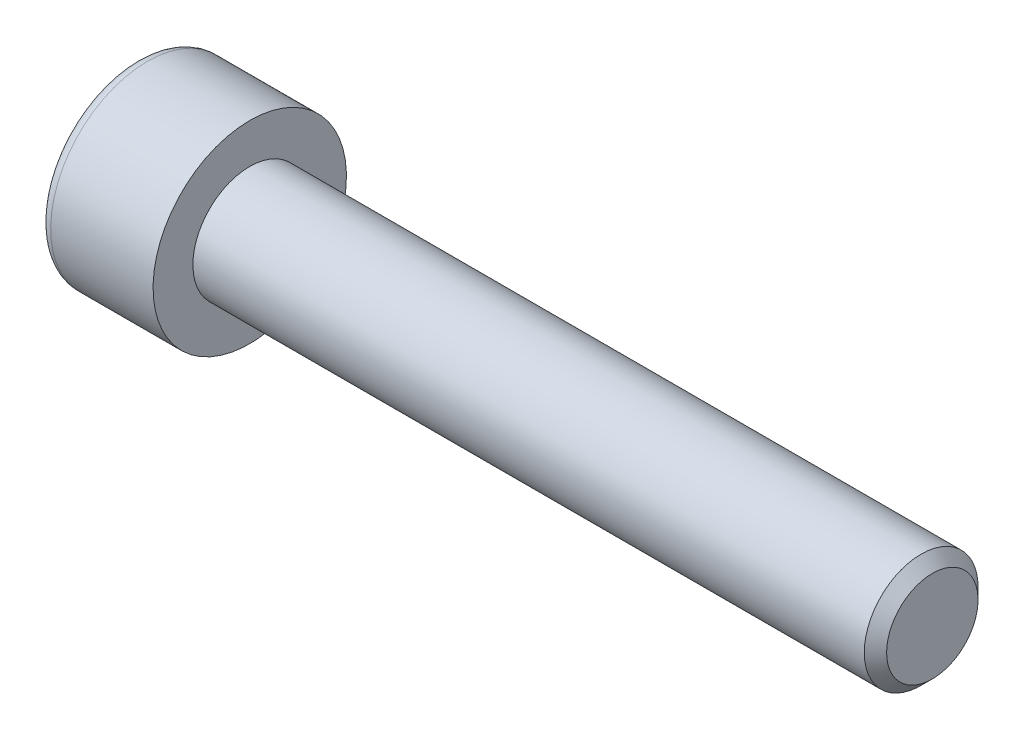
ISO-10303-21;
HEADER;
FILE_DESCRIPTION(('STEP AP214'),'2;1');
FILE_NAME('part.step','',(''),(''),'','','');
FILE_SCHEMA(('AUTOMOTIVE_DESIGN { 1 0 10303 214 1 1 1 1 }'));
ENDSEC;
DATA;
#1=APPLICATION_CONTEXT('core data for automotive mechanical design processes');
#2=APPLICATION_PROTOCOL_DEFINITION('international standard','automotive_design',2000,#1);
#3=PRODUCT_CONTEXT('',#1,'mechanical');
#4=PRODUCT('Part','Part','',(#3));
#5=PRODUCT_RELATED_PRODUCT_CATEGORY('part','',(#4));
#6=PRODUCT_DEFINITION_FORMATION('','',#4);
#7=PRODUCT_DEFINITION_CONTEXT('part definition',#1,'design');
#8=PRODUCT_DEFINITION('design','',#6,#7);
#9=PRODUCT_DEFINITION_SHAPE('','',#8);
#10=(LENGTH_UNIT() NAMED_UNIT(*) SI_UNIT(.MILLI.,.METRE.));
#11=(NAMED_UNIT(*) PLANE_ANGLE_UNIT() SI_UNIT($,.RADIAN.));
#12=(NAMED_UNIT(*) SI_UNIT($,.STERADIAN.) SOLID_ANGLE_UNIT());
#13=UNCERTAINTY_MEASURE_WITH_UNIT(LENGTH_MEASURE(1.E-05),#10,'distance_accuracy_value','');
#14=(GEOMETRIC_REPRESENTATION_CONTEXT(3) GLOBAL_UNCERTAINTY_ASSIGNED_CONTEXT((#13)) GLOBAL_UNIT_ASSIGNED_CONTEXT((#10,
#11,#12)) REPRESENTATION_CONTEXT('',''));
#15=CARTESIAN_POINT('',(0.,0.,0.));
#16=DIRECTION('',(0.,0.,1.));
#17=DIRECTION('',(1.,0.,0.));
#18=AXIS2_PLACEMENT_3D('',#15,#16,#17);
#19=CARTESIAN_POINT('',(-1.16666666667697,0.,0.));
#20=DIRECTION('',(-1.,0.,0.));
#21=DIRECTION('',(0.,0.,1.));
#22=AXIS2_PLACEMENT_3D('',#19,#20,#21);
#23=CONICAL_SURFACE('',#22,0.,1.04719755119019);
#24=CARTESIAN_POINT('',(-1.16666666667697,0.,0.));
#25=VERTEX_POINT('',#24);
#26=VERTEX_LOOP('',#25);
#27=FACE_BOUND('',#26,.T.);
#28=CARTESIAN_POINT('',(-2.50000000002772,-6.92989317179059E-12,-2.3094010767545));
#29=CARTESIAN_POINT('',(-2.47069554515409,-0.0878878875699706,-2.25865898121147));
#30=CARTESIAN_POINT('',(-2.44404467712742,-0.176534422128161,-2.20747888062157));
#31=CARTESIAN_POINT('',(-2.39752638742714,-0.355362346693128,-2.10423253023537));
#32=CARTESIAN_POINT('',(-2.37767542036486,-0.445546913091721,-2.05216444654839));
#33=CARTESIAN_POINT('',(-2.34677595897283,-0.624798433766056,-1.94867353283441));
#34=CARTESIAN_POINT('',(-2.33552178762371,-0.71383781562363,-1.89726662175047));
#35=CARTESIAN_POINT('',(-2.32208916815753,-0.892335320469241,-1.79421103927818));
#36=CARTESIAN_POINT('',(-2.3198995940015,-0.981792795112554,-1.74256274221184));
#37=CARTESIAN_POINT('',(-2.32446629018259,-1.14893448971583,-1.64606343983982));
#38=CARTESIAN_POINT('',(-2.33010128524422,-1.22664379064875,-1.60119795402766));
#39=CARTESIAN_POINT('',(-2.34795730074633,-1.38155614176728,-1.51175926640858));
#40=CARTESIAN_POINT('',(-2.36018441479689,-1.45875865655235,-1.46718637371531));
#41=CARTESIAN_POINT('',(-2.39074983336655,-1.61399014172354,-1.37756343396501));
#42=CARTESIAN_POINT('',(-2.40921764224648,-1.69199947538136,-1.33252472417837));
#43=CARTESIAN_POINT('',(-2.45113176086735,-1.84685497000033,-1.24311886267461));
#44=CARTESIAN_POINT('',(-2.47456822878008,-1.92370311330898,-1.19875056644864));
#45=CARTESIAN_POINT('',(-2.50000000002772,-1.99999999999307,-1.15470053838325));
#46=B_SPLINE_CURVE_WITH_KNOTS('',3,(#28,#29,#30,#31,#32,#33,#34,#35,#36,#37,#38,#39,#40,#41,#42,
#43,#44,#45),.UNSPECIFIED.,.F.,.F.,(4,2,2,2,2,2,2,2,4),(0.,0.317016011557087,0.634793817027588,
0.944707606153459,1.25424088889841,1.52370778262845,1.79342419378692,2.0691216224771,
2.34427797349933),.UNSPECIFIED.);
#47=CARTESIAN_POINT('',(-2.50000000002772,0.,-2.3094010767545));
#48=VERTEX_POINT('',#47);
#49=CARTESIAN_POINT('',(-2.50000000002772,-1.99999999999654,-1.15470053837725));
#50=VERTEX_POINT('',#49);
#51=EDGE_CURVE('E137',#48,#50,#46,.T.);
#52=ORIENTED_EDGE('',*,*,#51,.T.);
#53=CARTESIAN_POINT('',(-2.50000000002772,-2.,-1.15470053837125));
#54=CARTESIAN_POINT('',(-2.47263377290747,-2.,-1.05991107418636));
#55=CARTESIAN_POINT('',(-2.44757921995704,-2.,-0.964371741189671));
#56=CARTESIAN_POINT('',(-2.40329840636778,-2.,-0.771741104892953));
#57=CARTESIAN_POINT('',(-2.38408518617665,-2.,-0.674646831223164));
#58=CARTESIAN_POINT('',(-2.35318800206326,-2.,-0.481547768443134));
#59=CARTESIAN_POINT('',(-2.34133930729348,-2.,-0.385570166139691));
#60=CARTESIAN_POINT('',(-2.32543313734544,-2.,-0.193061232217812));
#61=CARTESIAN_POINT('',(-2.32136720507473,-2.,-0.0965306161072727));
#62=CARTESIAN_POINT('',(-2.32136720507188,-2.,0.0965306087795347));
#63=CARTESIAN_POINT('',(-2.32543313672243,-2.,0.193061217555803));
#64=CARTESIAN_POINT('',(-2.34133930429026,-2.,0.385570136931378));
#65=CARTESIAN_POINT('',(-2.35318799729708,-2.,0.481547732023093));
#66=CARTESIAN_POINT('',(-2.38408517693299,-2.,0.674646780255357));
#67=CARTESIAN_POINT('',(-2.40329839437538,-2.,0.771741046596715));
#68=CARTESIAN_POINT('',(-2.44757920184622,-2.,0.964371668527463));
#69=CARTESIAN_POINT('',(-2.47263375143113,-2.,1.05991099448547));
#70=CARTESIAN_POINT('',(-2.4999999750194,-2.,1.15470045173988));
#71=B_SPLINE_CURVE_WITH_KNOTS('',3,(#53,#54,#55,#56,#57,#58,#59,#60,#61,#62,#63,#64,#65,#66,#67,
#68,#69,#70),.UNSPECIFIED.,.F.,.F.,(4,2,2,2,2,2,2,2,4),(0.,0.296073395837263,0.592802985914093,
0.882630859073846,1.17214361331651,1.46165634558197,1.75148419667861,2.04821376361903,
2.34428713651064),.UNSPECIFIED.);
#72=CARTESIAN_POINT('',(-2.49999999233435,-2.00000001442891,1.15470048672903));
#73=VERTEX_POINT('',#72);
#74=EDGE_CURVE('E241',#50,#73,#71,.T.);
#75=ORIENTED_EDGE('',*,*,#74,.T.);
#76=CARTESIAN_POINT('',(-2.50000003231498,-2.00000000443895,1.15470049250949));
#77=CARTESIAN_POINT('',(-2.47069556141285,-1.91211212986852,1.20544260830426));
#78=CARTESIAN_POINT('',(-2.4440446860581,-1.82346559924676,1.25662271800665));
#79=CARTESIAN_POINT('',(-2.39752638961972,-1.64463767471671,1.35986907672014));
#80=CARTESIAN_POINT('',(-2.3776754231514,-1.55445310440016,1.41193715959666));
#81=CARTESIAN_POINT('',(-2.34677596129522,-1.37520157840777,1.51542807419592));
#82=CARTESIAN_POINT('',(-2.33552178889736,-1.28616219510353,1.56683498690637));
#83=CARTESIAN_POINT('',(-2.32208916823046,-1.10766468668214,1.66989057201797));
#84=CARTESIAN_POINT('',(-2.31989959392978,-1.01820720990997,1.7215388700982));
#85=CARTESIAN_POINT('',(-2.32446629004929,-0.851065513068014,1.81803817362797));
#86=CARTESIAN_POINT('',(-2.33010128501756,-0.773356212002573,1.86290365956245));
#87=CARTESIAN_POINT('',(-2.34795730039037,-0.618443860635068,1.95234234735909));
#88=CARTESIAN_POINT('',(-2.36018441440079,-0.541241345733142,1.9969152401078));
#89=CARTESIAN_POINT('',(-2.39074983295,-0.386009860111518,2.08653818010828));
#90=CARTESIAN_POINT('',(-2.40921764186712,-0.308000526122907,2.13157689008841));
#91=CARTESIAN_POINT('',(-2.4511317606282,-0.153145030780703,2.2209827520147));
#92=CARTESIAN_POINT('',(-2.47456822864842,-0.0762968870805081,2.26535104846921));
#93=CARTESIAN_POINT('',(-2.50000000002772,-6.92925556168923E-12,2.3094010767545));
#94=B_SPLINE_CURVE_WITH_KNOTS('',3,(#76,#77,#78,#79,#80,#81,#82,#83,#84,#85,#86,#87,#88,#89,#90,
#91,#92,#93),.UNSPECIFIED.,.F.,.F.,(4,2,2,2,2,2,2,2,4),(0.,0.317016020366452,0.634793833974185,
0.944707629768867,1.25424091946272,1.52370781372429,1.79342422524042,2.0691216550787,
2.34427800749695),.UNSPECIFIED.);
#95=CARTESIAN_POINT('',(-2.50000000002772,0.,2.3094010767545));
#96=VERTEX_POINT('',#95);
#97=EDGE_CURVE('E257',#73,#96,#94,.T.);
#98=ORIENTED_EDGE('',*,*,#97,.T.);
#99=CARTESIAN_POINT('',(-2.50000000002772,6.92876375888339E-12,2.3094010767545));
#100=CARTESIAN_POINT('',(-2.47069554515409,0.0878878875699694,2.25865898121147));
#101=CARTESIAN_POINT('',(-2.44404467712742,0.17653442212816,2.20747888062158));
#102=CARTESIAN_POINT('',(-2.39752638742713,0.355362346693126,2.10423253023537));
#103=CARTESIAN_POINT('',(-2.37767542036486,0.445546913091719,2.05216444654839));
#104=CARTESIAN_POINT('',(-2.34677595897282,0.624798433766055,1.94867353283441));
#105=CARTESIAN_POINT('',(-2.33552178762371,0.713837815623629,1.89726662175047));
#106=CARTESIAN_POINT('',(-2.32208916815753,0.89233532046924,1.79421103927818));
#107=CARTESIAN_POINT('',(-2.3198995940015,0.981792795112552,1.74256274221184));
#108=CARTESIAN_POINT('',(-2.32446629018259,1.14893448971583,1.64606343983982));
#109=CARTESIAN_POINT('',(-2.33010128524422,1.22664379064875,1.60119795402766));
#110=CARTESIAN_POINT('',(-2.34795730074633,1.38155614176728,1.51175926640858));
#111=CARTESIAN_POINT('',(-2.36018441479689,1.45875865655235,1.46718637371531));
#112=CARTESIAN_POINT('',(-2.39074983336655,1.61399014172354,1.37756343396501));
#113=CARTESIAN_POINT('',(-2.40921764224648,1.69199947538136,1.33252472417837));
#114=CARTESIAN_POINT('',(-2.45113176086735,1.84685497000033,1.24311886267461));
#115=CARTESIAN_POINT('',(-2.47456822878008,1.92370311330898,1.19875056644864));
#116=CARTESIAN_POINT('',(-2.50000000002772,1.99999999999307,1.15470053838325));
#117=B_SPLINE_CURVE_WITH_KNOTS('',3,(#99,#100,#101,#102,#103,#104,#105,#106,#107,#108,#109,#110,
#111,#112,#113,#114,#115,#116),.UNSPECIFIED.,.F.,.F.,(4,2,2,2,2,2,2,2,4),(0.,0.317016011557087,
0.634793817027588,0.944707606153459,1.25424088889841,1.52370778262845,1.79342419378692,
2.0691216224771,2.34427797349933),.UNSPECIFIED.);
#118=CARTESIAN_POINT('',(-2.50000000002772,1.99999999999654,1.15470053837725));
#119=VERTEX_POINT('',#118);
#120=EDGE_CURVE('E262',#96,#119,#117,.T.);
#121=ORIENTED_EDGE('',*,*,#120,.T.);
#122=CARTESIAN_POINT('',(-2.50000000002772,2.,1.15470053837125));
#123=CARTESIAN_POINT('',(-2.47263377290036,2.,1.05991107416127));
#124=CARTESIAN_POINT('',(-2.44757921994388,2.,0.964371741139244));
#125=CARTESIAN_POINT('',(-2.40329840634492,2.,0.77174110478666));
#126=CARTESIAN_POINT('',(-2.38408518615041,2.,0.674646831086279));
#127=CARTESIAN_POINT('',(-2.35318800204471,2.,0.48154776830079));
#128=CARTESIAN_POINT('',(-2.34133930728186,2.,0.385570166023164));
#129=CARTESIAN_POINT('',(-2.32543313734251,2.,0.193061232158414));
#130=CARTESIAN_POINT('',(-2.32136720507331,2.,0.0965306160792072));
#131=CARTESIAN_POINT('',(-2.32136720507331,2.,-0.0965306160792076));
#132=CARTESIAN_POINT('',(-2.32543313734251,2.,-0.193061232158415));
#133=CARTESIAN_POINT('',(-2.34133930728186,2.,-0.385570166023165));
#134=CARTESIAN_POINT('',(-2.35318800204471,2.,-0.481547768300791));
#135=CARTESIAN_POINT('',(-2.38408518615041,2.,-0.674646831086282));
#136=CARTESIAN_POINT('',(-2.40329840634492,2.,-0.771741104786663));
#137=CARTESIAN_POINT('',(-2.44757921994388,2.,-0.964371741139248));
#138=CARTESIAN_POINT('',(-2.47263377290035,2.,-1.05991107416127));
#139=CARTESIAN_POINT('',(-2.50000000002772,2.,-1.15470053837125));
#140=B_SPLINE_CURVE_WITH_KNOTS('',3,(#122,#123,#124,#125,#126,#127,#128,#129,#130,#131,#132,
#133,#134,#135,#136,#137,#138,#139),.UNSPECIFIED.,.F.,.F.,(4,2,2,2,2,2,2,2,4),(0.,
0.296073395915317,0.592802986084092,0.882630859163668,1.17214361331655,1.46165636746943,
1.751484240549,2.04821383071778,2.3442872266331),.UNSPECIFIED.);
#141=CARTESIAN_POINT('',(-2.50000000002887,2.,-1.15470053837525));
#142=VERTEX_POINT('',#141);
#143=EDGE_CURVE('E20',#119,#142,#140,.T.);
#144=ORIENTED_EDGE('',*,*,#143,.T.);
#145=CARTESIAN_POINT('',(-2.50000000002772,1.99999999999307,-1.15470053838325));
#146=CARTESIAN_POINT('',(-2.47069554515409,1.91211211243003,-1.20544263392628));
#147=CARTESIAN_POINT('',(-2.44404467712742,1.82346557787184,-1.25662273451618));
#148=CARTESIAN_POINT('',(-2.39752638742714,1.64463765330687,-1.35986908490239));
#149=CARTESIAN_POINT('',(-2.37767542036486,1.55445308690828,-1.41193716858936));
#150=CARTESIAN_POINT('',(-2.34677595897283,1.37520156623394,-1.51542808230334));
#151=CARTESIAN_POINT('',(-2.33552178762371,1.28616218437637,-1.56683499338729));
#152=CARTESIAN_POINT('',(-2.32208916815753,1.10766467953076,-1.66989057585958));
#153=CARTESIAN_POINT('',(-2.3198995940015,1.01820720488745,-1.72153887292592));
#154=CARTESIAN_POINT('',(-2.32446629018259,0.851065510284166,-1.81803817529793));
#155=CARTESIAN_POINT('',(-2.33010128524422,0.77335620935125,-1.86290366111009));
#156=CARTESIAN_POINT('',(-2.34795730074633,0.61844385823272,-1.95234234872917));
#157=CARTESIAN_POINT('',(-2.36018441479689,0.541241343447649,-1.99691524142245));
#158=CARTESIAN_POINT('',(-2.39074983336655,0.386009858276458,-2.08653818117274));
#159=CARTESIAN_POINT('',(-2.40921764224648,0.308000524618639,-2.13157689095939));
#160=CARTESIAN_POINT('',(-2.45113176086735,0.15314502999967,-2.22098275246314));
#161=CARTESIAN_POINT('',(-2.47456822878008,0.0762968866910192,-2.26535104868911));
#162=CARTESIAN_POINT('',(-2.50000000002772,6.92873559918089E-12,-2.3094010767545));
#163=B_SPLINE_CURVE_WITH_KNOTS('',3,(#145,#146,#147,#148,#149,#150,#151,#152,#153,#154,#155,
#156,#157,#158,#159,#160,#161,#162),.UNSPECIFIED.,.F.,.F.,(4,2,2,2,2,2,2,2,4),(0.,
0.317016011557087,0.634793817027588,0.944707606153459,1.25424088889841,1.52370778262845,
1.79342419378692,2.0691216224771,2.34427797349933),.UNSPECIFIED.);
#164=EDGE_CURVE('E90',#142,#48,#163,.T.);
#165=ORIENTED_EDGE('',*,*,#164,.T.);
#166=EDGE_LOOP('',(#52,#75,#98,#121,#144,#165));
#167=FACE_BOUND('',#166,.T.);
#168=ADVANCED_FACE('F16',(#27,#167),#23,.F.);
#169=CARTESIAN_POINT('',(-5.,2.,1.15470053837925));
#170=DIRECTION('',(0.,1.,0.));
#171=DIRECTION('',(0.,0.,1.));
#172=AXIS2_PLACEMENT_3D('',#169,#170,#171);
#173=PLANE('',#172);
#174=DIRECTION('',(1.,0.,0.));
#175=VECTOR('',#174,1.);
#176=CARTESIAN_POINT('',(-5.,2.,1.15470053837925));
#177=LINE('',#176,#175);
#178=CARTESIAN_POINT('',(-5.,2.,1.15470053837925));
#179=VERTEX_POINT('',#178);
#180=EDGE_CURVE('E84',#119,#179,#177,.F.);
#181=ORIENTED_EDGE('',*,*,#180,.T.);
#182=DIRECTION('',(0.,0.,1.));
#183=VECTOR('',#182,1.);
#184=CARTESIAN_POINT('',(-5.,2.,0.));
#185=LINE('',#184,#183);
#186=CARTESIAN_POINT('',(-5.,2.,-1.15470053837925));
#187=VERTEX_POINT('',#186);
#188=EDGE_CURVE('E78',#187,#179,#185,.T.);
#189=ORIENTED_EDGE('',*,*,#188,.F.);
#190=DIRECTION('',(1.,0.,0.));
#191=VECTOR('',#190,1.);
#192=CARTESIAN_POINT('',(-5.,2.,-1.15470053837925));
#193=LINE('',#192,#191);
#194=EDGE_CURVE('E81',#187,#142,#193,.T.);
#195=ORIENTED_EDGE('',*,*,#194,.T.);
#196=ORIENTED_EDGE('',*,*,#143,.F.);
#197=EDGE_LOOP('',(#181,#189,#195,#196));
#198=FACE_BOUND('',#197,.T.);
#199=ADVANCED_FACE('F80',(#198),#173,.F.);
#200=CARTESIAN_POINT('',(-5.,0.,2.3094010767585));
#201=DIRECTION('',(0.,0.5,0.866025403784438));
#202=DIRECTION('',(0.,-0.866025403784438,0.5));
#203=AXIS2_PLACEMENT_3D('',#200,#201,#202);
#204=PLANE('',#203);
#205=DIRECTION('',(1.,0.,0.));
#206=VECTOR('',#205,1.);
#207=CARTESIAN_POINT('',(-5.,0.,2.3094010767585));
#208=LINE('',#207,#206);
#209=CARTESIAN_POINT('',(-5.,0.,2.3094010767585));
#210=VERTEX_POINT('',#209);
#211=EDGE_CURVE('E260',#96,#210,#208,.F.);
#212=ORIENTED_EDGE('',*,*,#211,.T.);
#213=DIRECTION('',(0.,-0.866025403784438,0.5));
#214=VECTOR('',#213,1.);
#215=CARTESIAN_POINT('',(-5.,2.,1.15470053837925));
#216=LINE('',#215,#214);
#217=EDGE_CURVE('E89',#179,#210,#216,.T.);
#218=ORIENTED_EDGE('',*,*,#217,.F.);
#219=ORIENTED_EDGE('',*,*,#180,.F.);
#220=ORIENTED_EDGE('',*,*,#120,.F.);
#221=EDGE_LOOP('',(#212,#218,#219,#220));
#222=FACE_BOUND('',#221,.T.);
#223=ADVANCED_FACE('F226',(#222),#204,.F.);
#224=CARTESIAN_POINT('',(-5.,-2.,1.15470053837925));
#225=DIRECTION('',(0.,-0.5,0.866025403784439));
#226=DIRECTION('',(0.,-0.866025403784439,-0.5));
#227=AXIS2_PLACEMENT_3D('',#224,#225,#226);
#228=PLANE('',#227);
#229=DIRECTION('',(1.,0.,0.));
#230=VECTOR('',#229,1.);
#231=CARTESIAN_POINT('',(-5.,-2.,1.15470053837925));
#232=LINE('',#231,#230);
#233=CARTESIAN_POINT('',(-5.,-2.,1.15470053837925));
#234=VERTEX_POINT('',#233);
#235=EDGE_CURVE('E246',#73,#234,#232,.F.);
#236=ORIENTED_EDGE('',*,*,#235,.T.);
#237=DIRECTION('',(0.,-0.866025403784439,-0.5));
#238=VECTOR('',#237,1.);
#239=CARTESIAN_POINT('',(-5.,0.,2.3094010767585));
#240=LINE('',#239,#238);
#241=EDGE_CURVE('E114',#210,#234,#240,.T.);
#242=ORIENTED_EDGE('',*,*,#241,.F.);
#243=ORIENTED_EDGE('',*,*,#211,.F.);
#244=ORIENTED_EDGE('',*,*,#97,.F.);
#245=EDGE_LOOP('',(#236,#242,#243,#244));
#246=FACE_BOUND('',#245,.T.);
#247=ADVANCED_FACE('F222',(#246),#228,.F.);
#248=CARTESIAN_POINT('',(-5.,-2.,-1.15470053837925));
#249=DIRECTION('',(0.,-1.,0.));
#250=DIRECTION('',(0.,0.,-1.));
#251=AXIS2_PLACEMENT_3D('',#248,#249,#250);
#252=PLANE('',#251);
#253=DIRECTION('',(1.,0.,0.));
#254=VECTOR('',#253,1.);
#255=CARTESIAN_POINT('',(-5.,-2.,-1.15470053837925));
#256=LINE('',#255,#254);
#257=CARTESIAN_POINT('',(-5.,-2.,-1.15470053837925));
#258=VERTEX_POINT('',#257);
#259=EDGE_CURVE('E243',#50,#258,#256,.F.);
#260=ORIENTED_EDGE('',*,*,#259,.T.);
#261=DIRECTION('',(0.,0.,1.));
#262=VECTOR('',#261,1.);
#263=CARTESIAN_POINT('',(-5.,-2.,0.));
#264=LINE('',#263,#262);
#265=EDGE_CURVE('E104',#234,#258,#264,.F.);
#266=ORIENTED_EDGE('',*,*,#265,.F.);
#267=ORIENTED_EDGE('',*,*,#235,.F.);
#268=ORIENTED_EDGE('',*,*,#74,.F.);
#269=EDGE_LOOP('',(#260,#266,#267,#268));
#270=FACE_BOUND('',#269,.T.);
#271=ADVANCED_FACE('F219',(#270),#252,.F.);
#272=CARTESIAN_POINT('',(-5.,0.,-2.3094010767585));
#273=DIRECTION('',(0.,-0.5,-0.866025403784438));
#274=DIRECTION('',(0.,0.866025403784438,-0.5));
#275=AXIS2_PLACEMENT_3D('',#272,#273,#274);
#276=PLANE('',#275);
#277=DIRECTION('',(1.,0.,0.));
#278=VECTOR('',#277,1.);
#279=CARTESIAN_POINT('',(-5.,0.,-2.3094010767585));
#280=LINE('',#279,#278);
#281=CARTESIAN_POINT('',(-5.,0.,-2.3094010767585));
#282=VERTEX_POINT('',#281);
#283=EDGE_CURVE('E40',#48,#282,#280,.F.);
#284=ORIENTED_EDGE('',*,*,#283,.T.);
#285=DIRECTION('',(0.,0.866025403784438,-0.500000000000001));
#286=VECTOR('',#285,1.);
#287=CARTESIAN_POINT('',(-5.,-2.,-1.15470053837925));
#288=LINE('',#287,#286);
#289=EDGE_CURVE('E99',#258,#282,#288,.T.);
#290=ORIENTED_EDGE('',*,*,#289,.F.);
#291=ORIENTED_EDGE('',*,*,#259,.F.);
#292=ORIENTED_EDGE('',*,*,#51,.F.);
#293=EDGE_LOOP('',(#284,#290,#291,#292));
#294=FACE_BOUND('',#293,.T.);
#295=ADVANCED_FACE('F147',(#294),#276,.F.);
#296=CARTESIAN_POINT('',(-5.,2.,-1.15470053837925));
#297=DIRECTION('',(0.,0.5,-0.866025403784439));
#298=DIRECTION('',(0.,0.866025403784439,0.5));
#299=AXIS2_PLACEMENT_3D('',#296,#297,#298);
#300=PLANE('',#299);
#301=ORIENTED_EDGE('',*,*,#194,.F.);
#302=DIRECTION('',(0.,0.866025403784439,0.5));
#303=VECTOR('',#302,1.);
#304=CARTESIAN_POINT('',(-5.,0.,-2.3094010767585));
#305=LINE('',#304,#303);
#306=EDGE_CURVE('E94',#282,#187,#305,.T.);
#307=ORIENTED_EDGE('',*,*,#306,.F.);
#308=ORIENTED_EDGE('',*,*,#283,.F.);
#309=ORIENTED_EDGE('',*,*,#164,.F.);
#310=EDGE_LOOP('',(#301,#307,#308,#309));
#311=FACE_BOUND('',#310,.T.);
#312=ADVANCED_FACE('F93',(#311),#300,.F.);
#313=CARTESIAN_POINT('',(-5.,3.27970053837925,0.));
#314=DIRECTION('',(-1.,0.,0.));
#315=DIRECTION('',(0.,-1.,0.));
#316=AXIS2_PLACEMENT_3D('',#313,#314,#315);
#317=PLANE('',#316);
#318=CARTESIAN_POINT('',(-5.,0.,0.));
#319=DIRECTION('',(1.,0.,0.));
#320=DIRECTION('',(0.,1.,0.));
#321=AXIS2_PLACEMENT_3D('',#318,#319,#320);
#322=CIRCLE('',#321,3.75);
#323=CARTESIAN_POINT('',(-5.,3.75,0.));
#324=VERTEX_POINT('',#323);
#325=EDGE_CURVE('E100',#324,#324,#322,.T.);
#326=ORIENTED_EDGE('',*,*,#325,.F.);
#327=EDGE_LOOP('',(#326));
#328=FACE_BOUND('',#327,.T.);
#329=ORIENTED_EDGE('',*,*,#289,.T.);
#330=ORIENTED_EDGE('',*,*,#306,.T.);
#331=ORIENTED_EDGE('',*,*,#188,.T.);
#332=ORIENTED_EDGE('',*,*,#217,.T.);
#333=ORIENTED_EDGE('',*,*,#241,.T.);
#334=ORIENTED_EDGE('',*,*,#265,.T.);
#335=EDGE_LOOP('',(#329,#330,#331,#332,#333,#334));
#336=FACE_BOUND('',#335,.T.);
#337=ADVANCED_FACE('F97',(#328,#336),#317,.T.);
#338=CARTESIAN_POINT('',(-4.5,0.,0.));
#339=DIRECTION('',(1.,0.,0.));
#340=DIRECTION('',(0.,0.,-1.));
#341=AXIS2_PLACEMENT_3D('',#338,#339,#340);
#342=TOROIDAL_SURFACE('',#341,3.75,0.5);
#343=CARTESIAN_POINT('',(-4.5,0.,0.));
#344=DIRECTION('',(1.,0.,0.));
#345=DIRECTION('',(0.,1.,0.));
#346=AXIS2_PLACEMENT_3D('',#343,#344,#345);
#347=CIRCLE('',#346,4.25);
#348=CARTESIAN_POINT('',(-4.5,4.25,0.));
#349=VERTEX_POINT('',#348);
#350=EDGE_CURVE('E103',#349,#349,#347,.T.);
#351=ORIENTED_EDGE('',*,*,#350,.F.);
#352=EDGE_LOOP('',(#351));
#353=FACE_BOUND('',#352,.T.);
#354=ORIENTED_EDGE('',*,*,#325,.T.);
#355=EDGE_LOOP('',(#354));
#356=FACE_BOUND('',#355,.T.);
#357=ADVANCED_FACE('F153',(#353,#356),#342,.T.);
#358=CARTESIAN_POINT('',(-2.5,0.,0.));
#359=DIRECTION('',(1.,0.,0.));
#360=DIRECTION('',(0.,1.,0.));
#361=AXIS2_PLACEMENT_3D('',#358,#359,#360);
#362=CYLINDRICAL_SURFACE('',#361,4.25);
#363=CARTESIAN_POINT('',(0.,0.,0.));
#364=DIRECTION('',(1.,0.,0.));
#365=DIRECTION('',(0.,1.,0.));
#366=AXIS2_PLACEMENT_3D('',#363,#364,#365);
#367=CIRCLE('',#366,4.25);
#368=CARTESIAN_POINT('',(0.,4.25,0.));
#369=VERTEX_POINT('',#368);
#370=EDGE_CURVE('E129',#369,#369,#367,.T.);
#371=ORIENTED_EDGE('',*,*,#370,.F.);
#372=EDGE_LOOP('',(#371));
#373=FACE_BOUND('',#372,.T.);
#374=ORIENTED_EDGE('',*,*,#350,.T.);
#375=EDGE_LOOP('',(#374));
#376=FACE_BOUND('',#375,.T.);
#377=ADVANCED_FACE('F183',(#373,#376),#362,.T.);
#378=CARTESIAN_POINT('',(30.,1.25,0.));
#379=DIRECTION('',(1.,0.,0.));
#380=DIRECTION('',(0.,0.,-1.));
#381=AXIS2_PLACEMENT_3D('',#378,#379,#380);
#382=PLANE('',#381);
#383=CARTESIAN_POINT('',(29.9999999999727,0.,0.));
#384=DIRECTION('',(-1.,0.,0.));
#385=DIRECTION('',(0.,0.,1.));
#386=AXIS2_PLACEMENT_3D('',#383,#384,#385);
#387=CIRCLE('',#386,2.00923999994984);
#388=CARTESIAN_POINT('',(29.9999999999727,0.,2.00923999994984));
#389=VERTEX_POINT('',#388);
#390=EDGE_CURVE('E126',#389,#389,#387,.T.);
#391=ORIENTED_EDGE('',*,*,#390,.F.);
#392=EDGE_LOOP('',(#391));
#393=FACE_BOUND('',#392,.T.);
#394=ADVANCED_FACE('F188',(#393),#382,.T.);
#395=CARTESIAN_POINT('',(0.,3.375,0.));
#396=DIRECTION('',(1.,0.,0.));
#397=DIRECTION('',(0.,0.,-1.));
#398=AXIS2_PLACEMENT_3D('',#395,#396,#397);
#399=PLANE('',#398);
#400=ORIENTED_EDGE('',*,*,#370,.T.);
#401=EDGE_LOOP('',(#400));
#402=FACE_BOUND('',#401,.T.);
#403=CARTESIAN_POINT('',(0.,0.,0.));
#404=DIRECTION('',(1.,0.,0.));
#405=DIRECTION('',(0.,1.,0.));
#406=AXIS2_PLACEMENT_3D('',#403,#404,#405);
#407=CIRCLE('',#406,2.5);
#408=CARTESIAN_POINT('',(0.,2.5,0.));
#409=VERTEX_POINT('',#408);
#410=EDGE_CURVE('E31',#409,#409,#407,.T.);
#411=ORIENTED_EDGE('',*,*,#410,.F.);
#412=EDGE_LOOP('',(#411));
#413=FACE_BOUND('',#412,.T.);
#414=ADVANCED_FACE('F196',(#402,#413),#399,.T.);
#415=CARTESIAN_POINT('',(29.5092399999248,0.,0.));
#416=DIRECTION('',(-1.,0.,0.));
#417=DIRECTION('',(0.,0.,1.));
#418=AXIS2_PLACEMENT_3D('',#415,#416,#417);
#419=CONICAL_SURFACE('',#418,2.49999999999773,0.785398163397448);
#420=CARTESIAN_POINT('',(29.50924,0.,0.));
#421=DIRECTION('',(1.,0.,0.));
#422=DIRECTION('',(0.,1.,0.));
#423=AXIS2_PLACEMENT_3D('',#420,#421,#422);
#424=CIRCLE('',#423,2.5);
#425=CARTESIAN_POINT('',(29.50924,2.5,0.));
#426=VERTEX_POINT('',#425);
#427=EDGE_CURVE('E10',#426,#426,#424,.F.);
#428=ORIENTED_EDGE('',*,*,#427,.F.);
#429=EDGE_LOOP('',(#428));
#430=FACE_BOUND('',#429,.T.);
#431=ORIENTED_EDGE('',*,*,#390,.T.);
#432=EDGE_LOOP('',(#431));
#433=FACE_BOUND('',#432,.T.);
#434=ADVANCED_FACE('F192',(#430,#433),#419,.T.);
#435=CARTESIAN_POINT('',(19.,0.,0.));
#436=DIRECTION('',(1.,0.,0.));
#437=DIRECTION('',(0.,1.,0.));
#438=AXIS2_PLACEMENT_3D('',#435,#436,#437);
#439=CYLINDRICAL_SURFACE('',#438,2.5);
#440=ORIENTED_EDGE('',*,*,#410,.T.);
#441=EDGE_LOOP('',(#440));
#442=FACE_BOUND('',#441,.T.);
#443=ORIENTED_EDGE('',*,*,#427,.T.);
#444=EDGE_LOOP('',(#443));
#445=FACE_BOUND('',#444,.T.);
#446=ADVANCED_FACE('F18',(#442,#445),#439,.T.);
#447=CLOSED_SHELL('',(#168,#199,#223,#247,#271,#295,#312,#337,#357,#377,#394,#414,#434,#446));
#448=MANIFOLD_SOLID_BREP('B1',#447);
#449=ADVANCED_BREP_SHAPE_REPRESENTATION('',(#18,#448),#14);
#450=SHAPE_DEFINITION_REPRESENTATION(#9,#449);
ENDSEC;
END-ISO-10303-21;
